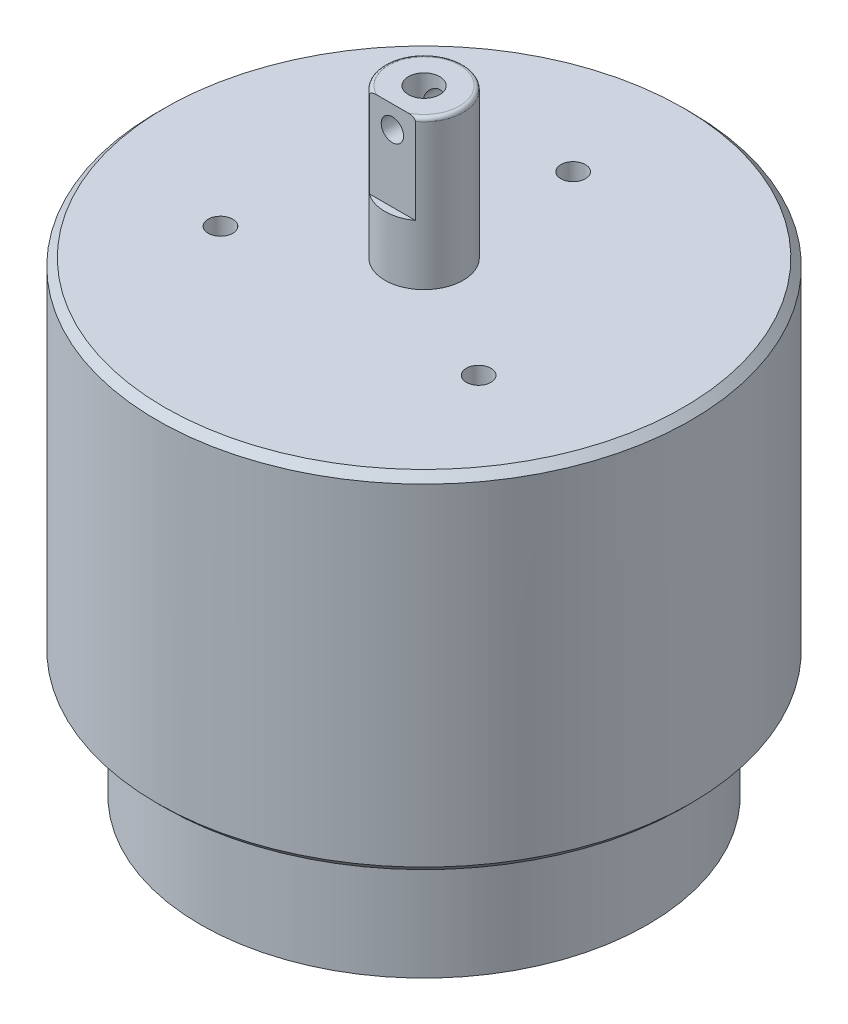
from build123d import *

# Parameters (mm, degrees)
SKETCH_1_R             = 35.8
EXTRUDE_1_DEPTH        = 23.25
HOLE_WIZARD_M4_1_D     = 3.3
HOLE_WIZARD_M4_1_DEPTH = 11.5
HOLE_WIZARD_M4_1_TIP   = 0.991420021
SKETCH_4_R             = 5.25
EXTRUDE_2_DEPTH        = 20
FILLET_1_R             = 0.5
SKETCH_5_W             = 9.627947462
SKETCH_5_H             = 2
CUT_EXTRUDE_1_DEPTH    = 12
HOLE_WIZARD_M5_1_D     = 4.2
HOLE_WIZARD_M5_1_DEPTH = 14
HOLE_WIZARD_M5_1_TIP   = 1.2618073
CHAMFER_1_SIZE         = 1
SKETCH_7_R             = 30
EXTRUDE_3_DEPTH        = 17
CHAMFER_2_SIZE         = 1
CHAMFER_3_SIZE         = 1
CHAMFER_3_SIZE2        = 3
SKETCH_8_R             = 1.5
CUT_EXTRUDE_2_DEPTH    = 69.965244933


with BuildPart() as part:
    # Sketch 1 → Extrude 1 (new, symmetric)
    with BuildSketch(Plane(origin=(0, 0, 0), x_dir=(1, 0, 0), z_dir=(0, 1, 0))):
        with Locations(Location((0, 0, 0), (0, 0, 90))):
            Circle(SKETCH_1_R)
    extrude(amount=EXTRUDE_1_DEPTH, both=True)

    # Hole Wizard M4 _1
    with Locations(Plane(origin=(0, 23.25, -20), x_dir=(0, 0, 1), z_dir=(0, 1, 0))):
        with Locations((0, 0), (30, -17.320508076), (30, 17.320508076)):
            Hole(HOLE_WIZARD_M4_1_D / 2, depth=HOLE_WIZARD_M4_1_DEPTH)
            with Locations((0, 0, -(HOLE_WIZARD_M4_1_DEPTH + HOLE_WIZARD_M4_1_TIP / 2))):  # 118° drill point
                Cone(0, HOLE_WIZARD_M4_1_D / 2, HOLE_WIZARD_M4_1_TIP, mode=Mode.SUBTRACT)

    # Sketch 4 → Extrude 2 (add)
    with BuildSketch(Plane(origin=(0, 23.25, 0), x_dir=(1, 0, 0), z_dir=(0, 1, 0))):
        with Locations(Location((0, 0, 0), (0, 0, 270))):
            Circle(SKETCH_4_R)
    extrude(amount=EXTRUDE_2_DEPTH)

    # Fillet 1
    fillet_1_edges = [part.edges().sort_by_distance(p)[0] for p in [
        (0, 43.25, -5.25),
    ]]
    fillet(fillet_1_edges, radius=FILLET_1_R)

    # Sketch 5 → Cut-Extrude 1 (cut)
    with BuildSketch(Plane(origin=(0, 43.25, 0), x_dir=(1, 0, 0), z_dir=(0, 1, 0))):
        with Locations((0, -5.25)):
            Rectangle(SKETCH_5_W, SKETCH_5_H)
    extrude(amount=-CUT_EXTRUDE_1_DEPTH, mode=Mode.SUBTRACT)

    # Hole Wizard M5 _1
    with Locations(Plane.ZX.offset(43.25)):
        with Locations((0, 0)):
            Hole(HOLE_WIZARD_M5_1_D / 2, depth=HOLE_WIZARD_M5_1_DEPTH)
            with Locations((0, 0, -(HOLE_WIZARD_M5_1_DEPTH + HOLE_WIZARD_M5_1_TIP / 2))):  # 118° drill point
                Cone(0, HOLE_WIZARD_M5_1_D / 2, HOLE_WIZARD_M5_1_TIP, mode=Mode.SUBTRACT)

    # Chamfer 1
    chamfer_1_edges = [part.edges().sort_by_distance(p)[0] for p in [
        (0, 23.25, 35.8),
    ]]
    chamfer(chamfer_1_edges, length=CHAMFER_1_SIZE)

    # Sketch 7 → Extrude 3 (add)
    with BuildSketch(Plane.XZ.offset(23.25)):
        with Locations(Location((0, 0, 0), (0, 0, 90))):
            Circle(SKETCH_7_R)
    extrude(amount=EXTRUDE_3_DEPTH)

    # Chamfer 2
    chamfer_2_edges = [part.edges().sort_by_distance(p)[0] for p in [
        (0, -23.25, 35.8),
    ]]
    chamfer(chamfer_2_edges, length=CHAMFER_2_SIZE)

    # Chamfer 3
    chamfer_3_edges = [part.edges().sort_by_distance(p)[0] for p in [
        (0, -40.25, -30),
    ]]
    chamfer_3_side = [part.faces().sort_by_distance(p)[0] for p in [
        (0, -31.75, -30),
    ]]
    chamfer(chamfer_3_edges, length=CHAMFER_3_SIZE, length2=CHAMFER_3_SIZE2, reference=chamfer_3_side[0])

    # Sketch 8 → Cut-Extrude 2 (cut, through all)
    with BuildSketch(Plane.XY.offset(4.25)):
        with Locations((0, 40.25)):
            Circle(SKETCH_8_R)
    extrude(amount=-CUT_EXTRUDE_2_DEPTH, mode=Mode.SUBTRACT)


solid = part.part
